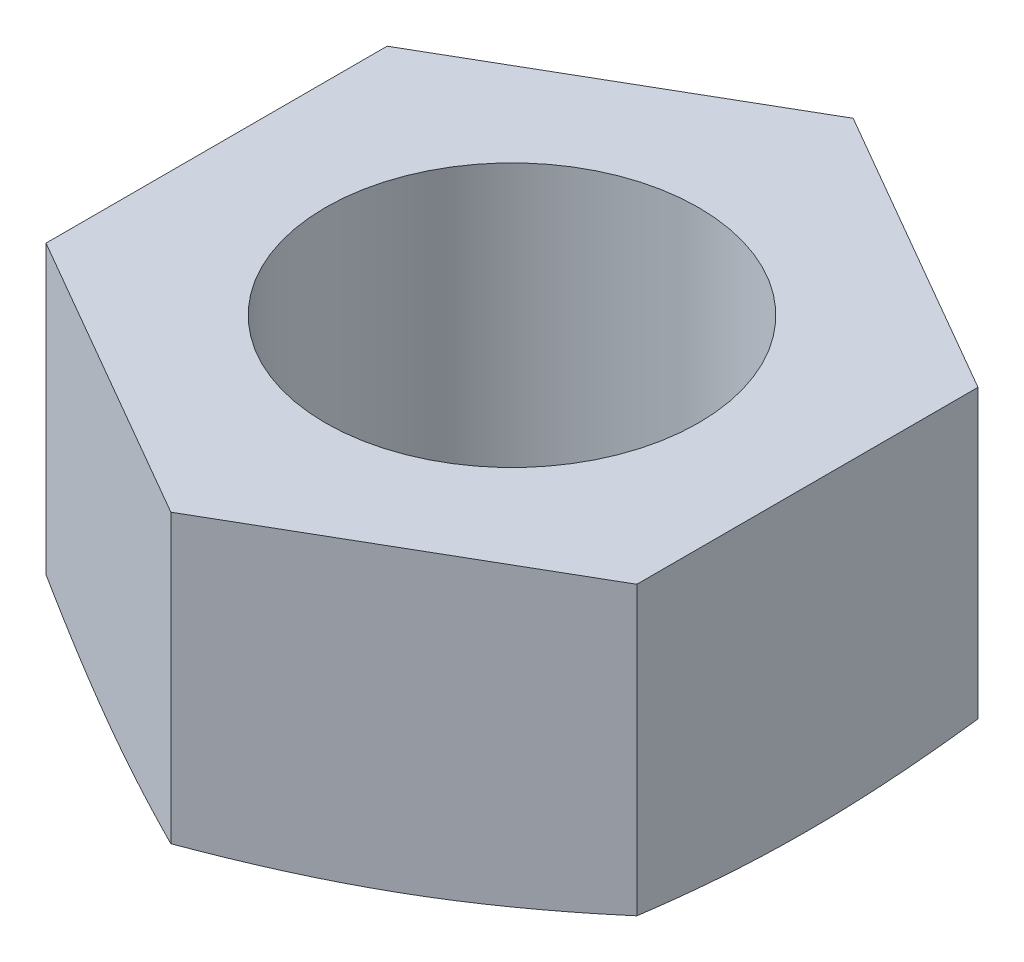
from build123d import *

# Parameters (mm, degrees)
SKETCH_2_W          = 115.410256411
SKETCH_2_H          = 94.230769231
CUT_EXTRUDE_1_DEPTH = 11


with BuildPart() as part:
    # Sketch 1 → Revolve 1 (revolve)
    with BuildSketch(Plane.XY, mode=Mode.PRIVATE) as revolve_1_sk:
        Polygon((6, 0), (8, 0), (11.875, 1), (11.875, 10), (6, 10), align=None)
    revolve(revolve_1_sk.sketch.rotate(Axis((0, 0, 0), (0, 1, 0)), 270), axis=Axis((0, 0, 0), (0, 1, 0)))

    # Sketch 2 → Cut-Extrude 1 (cut)
    with BuildSketch(Plane(origin=(0, 0, 0), x_dir=(1, 0, 0), z_dir=(0, 1, 0))):
        with Locations((0.538461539, 2.333333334)):
            Rectangle(SKETCH_2_W, SKETCH_2_H)
        Polygon((-9.5, 5.484827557), (-9.5, -5.484827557), (0, -10.969655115), (9.5, -5.484827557), (9.5, 5.484827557), (0, 10.969655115), align=None, mode=Mode.SUBTRACT)
    extrude(amount=CUT_EXTRUDE_1_DEPTH, mode=Mode.SUBTRACT)


solid = part.part
